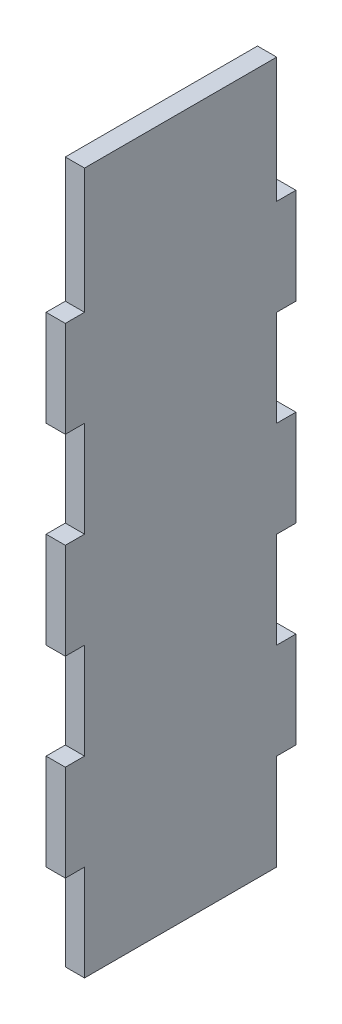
ISO-10303-21;
HEADER;
FILE_DESCRIPTION(('STEP AP214'),'2;1');
FILE_NAME('part.step','',(''),(''),'','','');
FILE_SCHEMA(('AUTOMOTIVE_DESIGN { 1 0 10303 214 1 1 1 1 }'));
ENDSEC;
DATA;
#1=APPLICATION_CONTEXT('core data for automotive mechanical design processes');
#2=APPLICATION_PROTOCOL_DEFINITION('international standard','automotive_design',2000,#1);
#3=PRODUCT_CONTEXT('',#1,'mechanical');
#4=PRODUCT('Part','Part','',(#3));
#5=PRODUCT_RELATED_PRODUCT_CATEGORY('part','',(#4));
#6=PRODUCT_DEFINITION_FORMATION('','',#4);
#7=PRODUCT_DEFINITION_CONTEXT('part definition',#1,'design');
#8=PRODUCT_DEFINITION('design','',#6,#7);
#9=PRODUCT_DEFINITION_SHAPE('','',#8);
#10=(LENGTH_UNIT() NAMED_UNIT(*) SI_UNIT(.MILLI.,.METRE.));
#11=(NAMED_UNIT(*) PLANE_ANGLE_UNIT() SI_UNIT($,.RADIAN.));
#12=(NAMED_UNIT(*) SI_UNIT($,.STERADIAN.) SOLID_ANGLE_UNIT());
#13=UNCERTAINTY_MEASURE_WITH_UNIT(LENGTH_MEASURE(1.E-05),#10,'distance_accuracy_value','');
#14=(GEOMETRIC_REPRESENTATION_CONTEXT(3) GLOBAL_UNCERTAINTY_ASSIGNED_CONTEXT((#13)) GLOBAL_UNIT_ASSIGNED_CONTEXT((#10,
#11,#12)) REPRESENTATION_CONTEXT('',''));
#15=CARTESIAN_POINT('',(0.,0.,0.));
#16=DIRECTION('',(0.,0.,1.));
#17=DIRECTION('',(1.,0.,0.));
#18=AXIS2_PLACEMENT_3D('',#15,#16,#17);
#19=CARTESIAN_POINT('',(0.,108.68170064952,20.));
#20=DIRECTION('',(0.,0.,1.));
#21=DIRECTION('',(-1.,0.,0.));
#22=AXIS2_PLACEMENT_3D('',#19,#20,#21);
#23=PLANE('',#22);
#24=DIRECTION('',(0.,-1.,0.));
#25=VECTOR('',#24,1.);
#26=CARTESIAN_POINT('',(-30.,-4.,20.));
#27=LINE('',#26,#25);
#28=CARTESIAN_POINT('',(-30.,26.,20.));
#29=VERTEX_POINT('',#28);
#30=CARTESIAN_POINT('',(-30.,16.,20.));
#31=VERTEX_POINT('',#30);
#32=EDGE_CURVE('E59',#29,#31,#27,.T.);
#33=ORIENTED_EDGE('',*,*,#32,.T.);
#34=DIRECTION('',(-1.,0.,0.));
#35=VECTOR('',#34,1.);
#36=CARTESIAN_POINT('',(-30.,16.,20.));
#37=LINE('',#36,#35);
#38=CARTESIAN_POINT('',(-28.,16.,20.));
#39=VERTEX_POINT('',#38);
#40=EDGE_CURVE('E244',#39,#31,#37,.T.);
#41=ORIENTED_EDGE('',*,*,#40,.F.);
#42=DIRECTION('',(0.,1.,0.));
#43=VECTOR('',#42,1.);
#44=CARTESIAN_POINT('',(-28.,-4.,20.));
#45=LINE('',#44,#43);
#46=CARTESIAN_POINT('',(-28.,26.,20.));
#47=VERTEX_POINT('',#46);
#48=EDGE_CURVE('E43',#39,#47,#45,.T.);
#49=ORIENTED_EDGE('',*,*,#48,.T.);
#50=DIRECTION('',(1.,0.,0.));
#51=VECTOR('',#50,1.);
#52=CARTESIAN_POINT('',(-28.,26.,20.));
#53=LINE('',#52,#51);
#54=EDGE_CURVE('E248',#29,#47,#53,.T.);
#55=ORIENTED_EDGE('',*,*,#54,.F.);
#56=EDGE_LOOP('',(#33,#41,#49,#55));
#57=FACE_BOUND('',#56,.T.);
#58=ADVANCED_FACE('F34',(#57),#23,.T.);
#59=CARTESIAN_POINT('',(-28.,-4.,20.));
#60=VERTEX_POINT('',#59);
#61=CARTESIAN_POINT('',(-28.,6.,20.));
#62=VERTEX_POINT('',#61);
#63=EDGE_CURVE('E11',#60,#62,#45,.T.);
#64=ORIENTED_EDGE('',*,*,#63,.T.);
#65=DIRECTION('',(1.,0.,0.));
#66=VECTOR('',#65,1.);
#67=CARTESIAN_POINT('',(-28.,6.,20.));
#68=LINE('',#67,#66);
#69=CARTESIAN_POINT('',(-30.,6.,20.));
#70=VERTEX_POINT('',#69);
#71=EDGE_CURVE('E51',#70,#62,#68,.T.);
#72=ORIENTED_EDGE('',*,*,#71,.F.);
#73=CARTESIAN_POINT('',(-30.,-4.,20.));
#74=VERTEX_POINT('',#73);
#75=EDGE_CURVE('E404',#70,#74,#27,.T.);
#76=ORIENTED_EDGE('',*,*,#75,.T.);
#77=DIRECTION('',(1.,0.,0.));
#78=VECTOR('',#77,1.);
#79=CARTESIAN_POINT('',(-30.,-4.,20.));
#80=LINE('',#79,#78);
#81=EDGE_CURVE('E398',#74,#60,#80,.T.);
#82=ORIENTED_EDGE('',*,*,#81,.T.);
#83=EDGE_LOOP('',(#64,#72,#76,#82));
#84=FACE_BOUND('',#83,.T.);
#85=ADVANCED_FACE('F467',(#84),#23,.T.);
#86=CARTESIAN_POINT('',(-30.,46.,20.));
#87=VERTEX_POINT('',#86);
#88=CARTESIAN_POINT('',(-30.,36.,20.));
#89=VERTEX_POINT('',#88);
#90=EDGE_CURVE('E403',#87,#89,#27,.T.);
#91=ORIENTED_EDGE('',*,*,#90,.T.);
#92=DIRECTION('',(-1.,0.,0.));
#93=VECTOR('',#92,1.);
#94=CARTESIAN_POINT('',(-30.,36.,20.));
#95=LINE('',#94,#93);
#96=CARTESIAN_POINT('',(-28.,36.,20.));
#97=VERTEX_POINT('',#96);
#98=EDGE_CURVE('E245',#97,#89,#95,.T.);
#99=ORIENTED_EDGE('',*,*,#98,.F.);
#100=CARTESIAN_POINT('',(-28.,46.,20.));
#101=VERTEX_POINT('',#100);
#102=EDGE_CURVE('E488',#97,#101,#45,.T.);
#103=ORIENTED_EDGE('',*,*,#102,.T.);
#104=DIRECTION('',(1.,0.,0.));
#105=VECTOR('',#104,1.);
#106=CARTESIAN_POINT('',(-28.,46.,20.));
#107=LINE('',#106,#105);
#108=EDGE_CURVE('E282',#87,#101,#107,.T.);
#109=ORIENTED_EDGE('',*,*,#108,.F.);
#110=EDGE_LOOP('',(#91,#99,#103,#109));
#111=FACE_BOUND('',#110,.T.);
#112=ADVANCED_FACE('F36',(#111),#23,.T.);
#113=DIRECTION('',(-1.,0.,0.));
#114=VECTOR('',#113,1.);
#115=CARTESIAN_POINT('',(-30.,56.,20.));
#116=LINE('',#115,#114);
#117=CARTESIAN_POINT('',(-28.,56.,20.));
#118=VERTEX_POINT('',#117);
#119=CARTESIAN_POINT('',(-30.,56.,20.));
#120=VERTEX_POINT('',#119);
#121=EDGE_CURVE('E277',#118,#120,#116,.T.);
#122=ORIENTED_EDGE('',*,*,#121,.F.);
#123=CARTESIAN_POINT('',(-28.,69.,20.));
#124=VERTEX_POINT('',#123);
#125=EDGE_CURVE('E45',#118,#124,#45,.T.);
#126=ORIENTED_EDGE('',*,*,#125,.T.);
#127=DIRECTION('',(-1.,0.,0.));
#128=VECTOR('',#127,1.);
#129=CARTESIAN_POINT('',(-30.,69.,20.));
#130=LINE('',#129,#128);
#131=CARTESIAN_POINT('',(-30.,69.,20.));
#132=VERTEX_POINT('',#131);
#133=EDGE_CURVE('E381',#124,#132,#130,.T.);
#134=ORIENTED_EDGE('',*,*,#133,.T.);
#135=EDGE_CURVE('E401',#132,#120,#27,.T.);
#136=ORIENTED_EDGE('',*,*,#135,.T.);
#137=EDGE_LOOP('',(#122,#126,#134,#136));
#138=FACE_BOUND('',#137,.T.);
#139=ADVANCED_FACE('F471',(#138),#23,.T.);
#140=CARTESIAN_POINT('',(0.,0.,0.));
#141=DIRECTION('',(0.,0.,-1.));
#142=DIRECTION('',(-1.,0.,0.));
#143=AXIS2_PLACEMENT_3D('',#140,#141,#142);
#144=PLANE('',#143);
#145=DIRECTION('',(0.,-1.,0.));
#146=VECTOR('',#145,1.);
#147=CARTESIAN_POINT('',(-30.,-4.,0.));
#148=LINE('',#147,#146);
#149=CARTESIAN_POINT('',(-30.,46.,0.));
#150=VERTEX_POINT('',#149);
#151=CARTESIAN_POINT('',(-30.,36.,0.));
#152=VERTEX_POINT('',#151);
#153=EDGE_CURVE('E395',#150,#152,#148,.T.);
#154=ORIENTED_EDGE('',*,*,#153,.F.);
#155=DIRECTION('',(-1.,0.,0.));
#156=VECTOR('',#155,1.);
#157=CARTESIAN_POINT('',(-28.,46.,0.));
#158=LINE('',#157,#156);
#159=CARTESIAN_POINT('',(-28.,46.,0.));
#160=VERTEX_POINT('',#159);
#161=EDGE_CURVE('E304',#160,#150,#158,.T.);
#162=ORIENTED_EDGE('',*,*,#161,.F.);
#163=DIRECTION('',(0.,1.,0.));
#164=VECTOR('',#163,1.);
#165=CARTESIAN_POINT('',(-28.,-4.,0.));
#166=LINE('',#165,#164);
#167=CARTESIAN_POINT('',(-28.,36.,0.));
#168=VERTEX_POINT('',#167);
#169=EDGE_CURVE('E444',#168,#160,#166,.T.);
#170=ORIENTED_EDGE('',*,*,#169,.F.);
#171=DIRECTION('',(1.,0.,0.));
#172=VECTOR('',#171,1.);
#173=CARTESIAN_POINT('',(-28.,36.,0.));
#174=LINE('',#173,#172);
#175=EDGE_CURVE('E332',#152,#168,#174,.T.);
#176=ORIENTED_EDGE('',*,*,#175,.F.);
#177=EDGE_LOOP('',(#154,#162,#170,#176));
#178=FACE_BOUND('',#177,.T.);
#179=ADVANCED_FACE('F442',(#178),#144,.T.);
#180=CARTESIAN_POINT('',(-28.,56.,0.));
#181=VERTEX_POINT('',#180);
#182=CARTESIAN_POINT('',(-28.,69.,0.));
#183=VERTEX_POINT('',#182);
#184=EDGE_CURVE('E387',#181,#183,#166,.T.);
#185=ORIENTED_EDGE('',*,*,#184,.F.);
#186=DIRECTION('',(1.,0.,0.));
#187=VECTOR('',#186,1.);
#188=CARTESIAN_POINT('',(-28.,56.,0.));
#189=LINE('',#188,#187);
#190=CARTESIAN_POINT('',(-30.,56.,0.));
#191=VERTEX_POINT('',#190);
#192=EDGE_CURVE('E309',#191,#181,#189,.T.);
#193=ORIENTED_EDGE('',*,*,#192,.F.);
#194=CARTESIAN_POINT('',(-30.,69.,0.));
#195=VERTEX_POINT('',#194);
#196=EDGE_CURVE('E393',#195,#191,#148,.T.);
#197=ORIENTED_EDGE('',*,*,#196,.F.);
#198=DIRECTION('',(-1.,0.,0.));
#199=VECTOR('',#198,1.);
#200=CARTESIAN_POINT('',(-30.,69.,0.));
#201=LINE('',#200,#199);
#202=EDGE_CURVE('E378',#183,#195,#201,.T.);
#203=ORIENTED_EDGE('',*,*,#202,.F.);
#204=EDGE_LOOP('',(#185,#193,#197,#203));
#205=FACE_BOUND('',#204,.T.);
#206=ADVANCED_FACE('F420',(#205),#144,.T.);
#207=CARTESIAN_POINT('',(-30.,26.,0.));
#208=VERTEX_POINT('',#207);
#209=CARTESIAN_POINT('',(-30.,16.,0.));
#210=VERTEX_POINT('',#209);
#211=EDGE_CURVE('E425',#208,#210,#148,.T.);
#212=ORIENTED_EDGE('',*,*,#211,.F.);
#213=DIRECTION('',(-1.,0.,0.));
#214=VECTOR('',#213,1.);
#215=CARTESIAN_POINT('',(-28.,26.,0.));
#216=LINE('',#215,#214);
#217=CARTESIAN_POINT('',(-28.,26.,0.));
#218=VERTEX_POINT('',#217);
#219=EDGE_CURVE('E327',#218,#208,#216,.T.);
#220=ORIENTED_EDGE('',*,*,#219,.F.);
#221=CARTESIAN_POINT('',(-28.,16.,0.));
#222=VERTEX_POINT('',#221);
#223=EDGE_CURVE('E386',#222,#218,#166,.T.);
#224=ORIENTED_EDGE('',*,*,#223,.F.);
#225=DIRECTION('',(1.,0.,0.));
#226=VECTOR('',#225,1.);
#227=CARTESIAN_POINT('',(-28.,16.,0.));
#228=LINE('',#227,#226);
#229=EDGE_CURVE('E356',#210,#222,#228,.T.);
#230=ORIENTED_EDGE('',*,*,#229,.F.);
#231=EDGE_LOOP('',(#212,#220,#224,#230));
#232=FACE_BOUND('',#231,.T.);
#233=ADVANCED_FACE('F623',(#232),#144,.T.);
#234=CARTESIAN_POINT('',(-30.,-4.,93.0273921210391));
#235=DIRECTION('',(1.,0.,0.));
#236=DIRECTION('',(0.,0.,-1.));
#237=AXIS2_PLACEMENT_3D('',#234,#235,#236);
#238=PLANE('',#237);
#239=ORIENTED_EDGE('',*,*,#135,.F.);
#240=DIRECTION('',(0.,0.,-1.));
#241=VECTOR('',#240,1.);
#242=CARTESIAN_POINT('',(-30.,69.,93.0273921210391));
#243=LINE('',#242,#241);
#244=EDGE_CURVE('E38',#132,#195,#243,.T.);
#245=ORIENTED_EDGE('',*,*,#244,.T.);
#246=ORIENTED_EDGE('',*,*,#196,.T.);
#247=DIRECTION('',(0.,0.,1.));
#248=VECTOR('',#247,1.);
#249=CARTESIAN_POINT('',(-30.,56.,-2.));
#250=LINE('',#249,#248);
#251=CARTESIAN_POINT('',(-30.,56.,-2.));
#252=VERTEX_POINT('',#251);
#253=EDGE_CURVE('E320',#252,#191,#250,.T.);
#254=ORIENTED_EDGE('',*,*,#253,.F.);
#255=DIRECTION('',(0.,1.,0.));
#256=VECTOR('',#255,1.);
#257=CARTESIAN_POINT('',(-30.,46.,-2.));
#258=LINE('',#257,#256);
#259=CARTESIAN_POINT('',(-30.,46.,-2.));
#260=VERTEX_POINT('',#259);
#261=EDGE_CURVE('E311',#260,#252,#258,.T.);
#262=ORIENTED_EDGE('',*,*,#261,.F.);
#263=DIRECTION('',(0.,0.,1.));
#264=VECTOR('',#263,1.);
#265=CARTESIAN_POINT('',(-30.,46.,-2.));
#266=LINE('',#265,#264);
#267=EDGE_CURVE('E322',#260,#150,#266,.T.);
#268=ORIENTED_EDGE('',*,*,#267,.T.);
#269=ORIENTED_EDGE('',*,*,#153,.T.);
#270=DIRECTION('',(0.,0.,1.));
#271=VECTOR('',#270,1.);
#272=CARTESIAN_POINT('',(-30.,36.,-2.));
#273=LINE('',#272,#271);
#274=CARTESIAN_POINT('',(-30.,36.,-2.));
#275=VERTEX_POINT('',#274);
#276=EDGE_CURVE('E343',#275,#152,#273,.T.);
#277=ORIENTED_EDGE('',*,*,#276,.F.);
#278=DIRECTION('',(0.,1.,0.));
#279=VECTOR('',#278,1.);
#280=CARTESIAN_POINT('',(-30.,26.,-2.));
#281=LINE('',#280,#279);
#282=CARTESIAN_POINT('',(-30.,26.,-2.));
#283=VERTEX_POINT('',#282);
#284=EDGE_CURVE('E334',#283,#275,#281,.T.);
#285=ORIENTED_EDGE('',*,*,#284,.F.);
#286=DIRECTION('',(0.,0.,1.));
#287=VECTOR('',#286,1.);
#288=CARTESIAN_POINT('',(-30.,26.,-2.));
#289=LINE('',#288,#287);
#290=EDGE_CURVE('E346',#283,#208,#289,.T.);
#291=ORIENTED_EDGE('',*,*,#290,.T.);
#292=ORIENTED_EDGE('',*,*,#211,.T.);
#293=DIRECTION('',(0.,0.,1.));
#294=VECTOR('',#293,1.);
#295=CARTESIAN_POINT('',(-30.,16.,-2.));
#296=LINE('',#295,#294);
#297=CARTESIAN_POINT('',(-30.,16.,-2.));
#298=VERTEX_POINT('',#297);
#299=EDGE_CURVE('E369',#298,#210,#296,.T.);
#300=ORIENTED_EDGE('',*,*,#299,.F.);
#301=DIRECTION('',(0.,1.,0.));
#302=VECTOR('',#301,1.);
#303=CARTESIAN_POINT('',(-30.,6.,-2.));
#304=LINE('',#303,#302);
#305=CARTESIAN_POINT('',(-30.,6.,-2.));
#306=VERTEX_POINT('',#305);
#307=EDGE_CURVE('E358',#306,#298,#304,.T.);
#308=ORIENTED_EDGE('',*,*,#307,.F.);
#309=DIRECTION('',(0.,0.,1.));
#310=VECTOR('',#309,1.);
#311=CARTESIAN_POINT('',(-30.,6.,-2.));
#312=LINE('',#311,#310);
#313=CARTESIAN_POINT('',(-30.,6.,0.));
#314=VERTEX_POINT('',#313);
#315=EDGE_CURVE('E372',#306,#314,#312,.T.);
#316=ORIENTED_EDGE('',*,*,#315,.T.);
#317=CARTESIAN_POINT('',(-30.,-4.,0.));
#318=VERTEX_POINT('',#317);
#319=EDGE_CURVE('E396',#314,#318,#148,.T.);
#320=ORIENTED_EDGE('',*,*,#319,.T.);
#321=DIRECTION('',(0.,0.,-1.));
#322=VECTOR('',#321,1.);
#323=CARTESIAN_POINT('',(-30.,-4.,93.0273921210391));
#324=LINE('',#323,#322);
#325=EDGE_CURVE('E392',#74,#318,#324,.T.);
#326=ORIENTED_EDGE('',*,*,#325,.F.);
#327=ORIENTED_EDGE('',*,*,#75,.F.);
#328=DIRECTION('',(0.,0.,-1.));
#329=VECTOR('',#328,1.);
#330=CARTESIAN_POINT('',(-30.,6.,22.));
#331=LINE('',#330,#329);
#332=CARTESIAN_POINT('',(-30.,6.,22.));
#333=VERTEX_POINT('',#332);
#334=EDGE_CURVE('E229',#333,#70,#331,.T.);
#335=ORIENTED_EDGE('',*,*,#334,.F.);
#336=DIRECTION('',(0.,-1.,0.));
#337=VECTOR('',#336,1.);
#338=CARTESIAN_POINT('',(-30.,6.,22.));
#339=LINE('',#338,#337);
#340=CARTESIAN_POINT('',(-30.,16.,22.));
#341=VERTEX_POINT('',#340);
#342=EDGE_CURVE('E221',#341,#333,#339,.T.);
#343=ORIENTED_EDGE('',*,*,#342,.F.);
#344=DIRECTION('',(0.,0.,-1.));
#345=VECTOR('',#344,1.);
#346=CARTESIAN_POINT('',(-30.,16.,22.));
#347=LINE('',#346,#345);
#348=EDGE_CURVE('E226',#341,#31,#347,.T.);
#349=ORIENTED_EDGE('',*,*,#348,.T.);
#350=ORIENTED_EDGE('',*,*,#32,.F.);
#351=DIRECTION('',(0.,0.,-1.));
#352=VECTOR('',#351,1.);
#353=CARTESIAN_POINT('',(-30.,26.,22.));
#354=LINE('',#353,#352);
#355=CARTESIAN_POINT('',(-30.,26.,22.));
#356=VERTEX_POINT('',#355);
#357=EDGE_CURVE('E271',#356,#29,#354,.T.);
#358=ORIENTED_EDGE('',*,*,#357,.F.);
#359=DIRECTION('',(0.,-1.,0.));
#360=VECTOR('',#359,1.);
#361=CARTESIAN_POINT('',(-30.,26.,22.));
#362=LINE('',#361,#360);
#363=CARTESIAN_POINT('',(-30.,36.,22.));
#364=VERTEX_POINT('',#363);
#365=EDGE_CURVE('E257',#364,#356,#362,.T.);
#366=ORIENTED_EDGE('',*,*,#365,.F.);
#367=DIRECTION('',(0.,0.,-1.));
#368=VECTOR('',#367,1.);
#369=CARTESIAN_POINT('',(-30.,36.,22.));
#370=LINE('',#369,#368);
#371=EDGE_CURVE('E274',#364,#89,#370,.T.);
#372=ORIENTED_EDGE('',*,*,#371,.T.);
#373=ORIENTED_EDGE('',*,*,#90,.F.);
#374=DIRECTION('',(0.,0.,-1.));
#375=VECTOR('',#374,1.);
#376=CARTESIAN_POINT('',(-30.,46.,22.));
#377=LINE('',#376,#375);
#378=CARTESIAN_POINT('',(-30.,46.,22.));
#379=VERTEX_POINT('',#378);
#380=EDGE_CURVE('E298',#379,#87,#377,.T.);
#381=ORIENTED_EDGE('',*,*,#380,.F.);
#382=DIRECTION('',(0.,-1.,0.));
#383=VECTOR('',#382,1.);
#384=CARTESIAN_POINT('',(-30.,46.,22.));
#385=LINE('',#384,#383);
#386=CARTESIAN_POINT('',(-30.,56.,22.));
#387=VERTEX_POINT('',#386);
#388=EDGE_CURVE('E281',#387,#379,#385,.T.);
#389=ORIENTED_EDGE('',*,*,#388,.F.);
#390=DIRECTION('',(0.,0.,-1.));
#391=VECTOR('',#390,1.);
#392=CARTESIAN_POINT('',(-30.,56.,22.));
#393=LINE('',#392,#391);
#394=EDGE_CURVE('E301',#387,#120,#393,.T.);
#395=ORIENTED_EDGE('',*,*,#394,.T.);
#396=EDGE_LOOP('',(#239,#245,#246,#254,#262,#268,#269,#277,#285,#291,#292,#300,#308,#316,#320,
#326,#327,#335,#343,#349,#350,#358,#366,#372,#373,#381,#389,#395));
#397=FACE_BOUND('',#396,.T.);
#398=ADVANCED_FACE('F224',(#397),#238,.F.);
#399=CARTESIAN_POINT('',(-30.,-4.,93.0273921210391));
#400=DIRECTION('',(0.,1.,0.));
#401=DIRECTION('',(0.,0.,1.));
#402=AXIS2_PLACEMENT_3D('',#399,#400,#401);
#403=PLANE('',#402);
#404=ORIENTED_EDGE('',*,*,#81,.F.);
#405=ORIENTED_EDGE('',*,*,#325,.T.);
#406=DIRECTION('',(1.,0.,0.));
#407=VECTOR('',#406,1.);
#408=CARTESIAN_POINT('',(-30.,-4.,0.));
#409=LINE('',#408,#407);
#410=CARTESIAN_POINT('',(-28.,-4.,0.));
#411=VERTEX_POINT('',#410);
#412=EDGE_CURVE('E388',#318,#411,#409,.T.);
#413=ORIENTED_EDGE('',*,*,#412,.T.);
#414=DIRECTION('',(0.,0.,-1.));
#415=VECTOR('',#414,1.);
#416=CARTESIAN_POINT('',(-28.,-4.,93.0273921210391));
#417=LINE('',#416,#415);
#418=EDGE_CURVE('E391',#60,#411,#417,.T.);
#419=ORIENTED_EDGE('',*,*,#418,.F.);
#420=EDGE_LOOP('',(#404,#405,#413,#419));
#421=FACE_BOUND('',#420,.T.);
#422=ADVANCED_FACE('F605',(#421),#403,.F.);
#423=CARTESIAN_POINT('',(-28.,-4.,93.0273921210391));
#424=DIRECTION('',(-1.,0.,0.));
#425=DIRECTION('',(0.,0.,1.));
#426=AXIS2_PLACEMENT_3D('',#423,#424,#425);
#427=PLANE('',#426);
#428=ORIENTED_EDGE('',*,*,#63,.F.);
#429=ORIENTED_EDGE('',*,*,#418,.T.);
#430=CARTESIAN_POINT('',(-28.,6.,0.));
#431=VERTEX_POINT('',#430);
#432=EDGE_CURVE('E383',#411,#431,#166,.T.);
#433=ORIENTED_EDGE('',*,*,#432,.T.);
#434=DIRECTION('',(0.,0.,1.));
#435=VECTOR('',#434,1.);
#436=CARTESIAN_POINT('',(-28.,6.,-2.));
#437=LINE('',#436,#435);
#438=CARTESIAN_POINT('',(-28.,6.,-2.));
#439=VERTEX_POINT('',#438);
#440=EDGE_CURVE('E375',#439,#431,#437,.T.);
#441=ORIENTED_EDGE('',*,*,#440,.F.);
#442=DIRECTION('',(0.,-1.,0.));
#443=VECTOR('',#442,1.);
#444=CARTESIAN_POINT('',(-28.,6.,-2.));
#445=LINE('',#444,#443);
#446=CARTESIAN_POINT('',(-28.,16.,-2.));
#447=VERTEX_POINT('',#446);
#448=EDGE_CURVE('E352',#447,#439,#445,.T.);
#449=ORIENTED_EDGE('',*,*,#448,.F.);
#450=DIRECTION('',(0.,0.,1.));
#451=VECTOR('',#450,1.);
#452=CARTESIAN_POINT('',(-28.,16.,-2.));
#453=LINE('',#452,#451);
#454=EDGE_CURVE('E362',#447,#222,#453,.T.);
#455=ORIENTED_EDGE('',*,*,#454,.T.);
#456=ORIENTED_EDGE('',*,*,#223,.T.);
#457=DIRECTION('',(0.,0.,1.));
#458=VECTOR('',#457,1.);
#459=CARTESIAN_POINT('',(-28.,26.,-2.));
#460=LINE('',#459,#458);
#461=CARTESIAN_POINT('',(-28.,26.,-2.));
#462=VERTEX_POINT('',#461);
#463=EDGE_CURVE('E349',#462,#218,#460,.T.);
#464=ORIENTED_EDGE('',*,*,#463,.F.);
#465=DIRECTION('',(0.,-1.,0.));
#466=VECTOR('',#465,1.);
#467=CARTESIAN_POINT('',(-28.,26.,-2.));
#468=LINE('',#467,#466);
#469=CARTESIAN_POINT('',(-28.,36.,-2.));
#470=VERTEX_POINT('',#469);
#471=EDGE_CURVE('E328',#470,#462,#468,.T.);
#472=ORIENTED_EDGE('',*,*,#471,.F.);
#473=DIRECTION('',(0.,0.,1.));
#474=VECTOR('',#473,1.);
#475=CARTESIAN_POINT('',(-28.,36.,-2.));
#476=LINE('',#475,#474);
#477=EDGE_CURVE('E338',#470,#168,#476,.T.);
#478=ORIENTED_EDGE('',*,*,#477,.T.);
#479=ORIENTED_EDGE('',*,*,#169,.T.);
#480=DIRECTION('',(0.,0.,1.));
#481=VECTOR('',#480,1.);
#482=CARTESIAN_POINT('',(-28.,46.,-2.));
#483=LINE('',#482,#481);
#484=CARTESIAN_POINT('',(-28.,46.,-2.));
#485=VERTEX_POINT('',#484);
#486=EDGE_CURVE('E325',#485,#160,#483,.T.);
#487=ORIENTED_EDGE('',*,*,#486,.F.);
#488=DIRECTION('',(0.,-1.,0.));
#489=VECTOR('',#488,1.);
#490=CARTESIAN_POINT('',(-28.,46.,-2.));
#491=LINE('',#490,#489);
#492=CARTESIAN_POINT('',(-28.,56.,-2.));
#493=VERTEX_POINT('',#492);
#494=EDGE_CURVE('E305',#493,#485,#491,.T.);
#495=ORIENTED_EDGE('',*,*,#494,.F.);
#496=DIRECTION('',(0.,0.,1.));
#497=VECTOR('',#496,1.);
#498=CARTESIAN_POINT('',(-28.,56.,-2.));
#499=LINE('',#498,#497);
#500=EDGE_CURVE('E315',#493,#181,#499,.T.);
#501=ORIENTED_EDGE('',*,*,#500,.T.);
#502=ORIENTED_EDGE('',*,*,#184,.T.);
#503=DIRECTION('',(0.,0.,-1.));
#504=VECTOR('',#503,1.);
#505=CARTESIAN_POINT('',(-28.,69.,93.0273921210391));
#506=LINE('',#505,#504);
#507=EDGE_CURVE('E382',#124,#183,#506,.T.);
#508=ORIENTED_EDGE('',*,*,#507,.F.);
#509=ORIENTED_EDGE('',*,*,#125,.F.);
#510=DIRECTION('',(0.,0.,-1.));
#511=VECTOR('',#510,1.);
#512=CARTESIAN_POINT('',(-28.,56.,22.));
#513=LINE('',#512,#511);
#514=CARTESIAN_POINT('',(-28.,56.,22.));
#515=VERTEX_POINT('',#514);
#516=EDGE_CURVE('E288',#515,#118,#513,.T.);
#517=ORIENTED_EDGE('',*,*,#516,.F.);
#518=DIRECTION('',(0.,1.,0.));
#519=VECTOR('',#518,1.);
#520=CARTESIAN_POINT('',(-28.,56.,22.));
#521=LINE('',#520,#519);
#522=CARTESIAN_POINT('',(-28.,46.,22.));
#523=VERTEX_POINT('',#522);
#524=EDGE_CURVE('E286',#523,#515,#521,.T.);
#525=ORIENTED_EDGE('',*,*,#524,.F.);
#526=DIRECTION('',(0.,0.,-1.));
#527=VECTOR('',#526,1.);
#528=CARTESIAN_POINT('',(-28.,46.,22.));
#529=LINE('',#528,#527);
#530=EDGE_CURVE('E295',#523,#101,#529,.T.);
#531=ORIENTED_EDGE('',*,*,#530,.T.);
#532=ORIENTED_EDGE('',*,*,#102,.F.);
#533=DIRECTION('',(0.,0.,-1.));
#534=VECTOR('',#533,1.);
#535=CARTESIAN_POINT('',(-28.,36.,22.));
#536=LINE('',#535,#534);
#537=CARTESIAN_POINT('',(-28.,36.,22.));
#538=VERTEX_POINT('',#537);
#539=EDGE_CURVE('E262',#538,#97,#536,.T.);
#540=ORIENTED_EDGE('',*,*,#539,.F.);
#541=DIRECTION('',(0.,1.,0.));
#542=VECTOR('',#541,1.);
#543=CARTESIAN_POINT('',(-28.,36.,22.));
#544=LINE('',#543,#542);
#545=CARTESIAN_POINT('',(-28.,26.,22.));
#546=VERTEX_POINT('',#545);
#547=EDGE_CURVE('E261',#546,#538,#544,.T.);
#548=ORIENTED_EDGE('',*,*,#547,.F.);
#549=DIRECTION('',(0.,0.,-1.));
#550=VECTOR('',#549,1.);
#551=CARTESIAN_POINT('',(-28.,26.,22.));
#552=LINE('',#551,#550);
#553=EDGE_CURVE('E268',#546,#47,#552,.T.);
#554=ORIENTED_EDGE('',*,*,#553,.T.);
#555=ORIENTED_EDGE('',*,*,#48,.F.);
#556=DIRECTION('',(0.,0.,-1.));
#557=VECTOR('',#556,1.);
#558=CARTESIAN_POINT('',(-28.,16.,22.));
#559=LINE('',#558,#557);
#560=CARTESIAN_POINT('',(-28.,16.,22.));
#561=VERTEX_POINT('',#560);
#562=EDGE_CURVE('E596',#561,#39,#559,.T.);
#563=ORIENTED_EDGE('',*,*,#562,.F.);
#564=DIRECTION('',(0.,1.,0.));
#565=VECTOR('',#564,1.);
#566=CARTESIAN_POINT('',(-28.,16.,22.));
#567=LINE('',#566,#565);
#568=CARTESIAN_POINT('',(-28.,6.,22.));
#569=VERTEX_POINT('',#568);
#570=EDGE_CURVE('E238',#569,#561,#567,.T.);
#571=ORIENTED_EDGE('',*,*,#570,.F.);
#572=DIRECTION('',(0.,0.,-1.));
#573=VECTOR('',#572,1.);
#574=CARTESIAN_POINT('',(-28.,6.,22.));
#575=LINE('',#574,#573);
#576=EDGE_CURVE('E250',#569,#62,#575,.T.);
#577=ORIENTED_EDGE('',*,*,#576,.T.);
#578=EDGE_LOOP('',(#428,#429,#433,#441,#449,#455,#456,#464,#472,#478,#479,#487,#495,#501,#502,
#508,#509,#517,#525,#531,#532,#540,#548,#554,#555,#563,#571,#577));
#579=FACE_BOUND('',#578,.T.);
#580=ADVANCED_FACE('F447',(#579),#427,.F.);
#581=CARTESIAN_POINT('',(-30.,69.,93.0273921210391));
#582=DIRECTION('',(0.,-1.,0.));
#583=DIRECTION('',(0.,0.,-1.));
#584=AXIS2_PLACEMENT_3D('',#581,#582,#583);
#585=PLANE('',#584);
#586=ORIENTED_EDGE('',*,*,#133,.F.);
#587=ORIENTED_EDGE('',*,*,#507,.T.);
#588=ORIENTED_EDGE('',*,*,#202,.T.);
#589=ORIENTED_EDGE('',*,*,#244,.F.);
#590=EDGE_LOOP('',(#586,#587,#588,#589));
#591=FACE_BOUND('',#590,.T.);
#592=ADVANCED_FACE('F414',(#591),#585,.F.);
#593=DIRECTION('',(-1.,0.,0.));
#594=VECTOR('',#593,1.);
#595=CARTESIAN_POINT('',(-28.,6.,0.));
#596=LINE('',#595,#594);
#597=EDGE_CURVE('E351',#431,#314,#596,.T.);
#598=ORIENTED_EDGE('',*,*,#597,.F.);
#599=ORIENTED_EDGE('',*,*,#432,.F.);
#600=ORIENTED_EDGE('',*,*,#412,.F.);
#601=ORIENTED_EDGE('',*,*,#319,.F.);
#602=EDGE_LOOP('',(#598,#599,#600,#601));
#603=FACE_BOUND('',#602,.T.);
#604=ADVANCED_FACE('F642',(#603),#144,.T.);
#605=CARTESIAN_POINT('',(-28.,6.,-2.));
#606=DIRECTION('',(0.,1.,0.));
#607=DIRECTION('',(0.,0.,1.));
#608=AXIS2_PLACEMENT_3D('',#605,#606,#607);
#609=PLANE('',#608);
#610=ORIENTED_EDGE('',*,*,#597,.T.);
#611=ORIENTED_EDGE('',*,*,#315,.F.);
#612=DIRECTION('',(-1.,0.,0.));
#613=VECTOR('',#612,1.);
#614=CARTESIAN_POINT('',(-28.,6.,-2.));
#615=LINE('',#614,#613);
#616=EDGE_CURVE('E355',#439,#306,#615,.T.);
#617=ORIENTED_EDGE('',*,*,#616,.F.);
#618=ORIENTED_EDGE('',*,*,#440,.T.);
#619=EDGE_LOOP('',(#610,#611,#617,#618));
#620=FACE_BOUND('',#619,.T.);
#621=ADVANCED_FACE('F612',(#620),#609,.F.);
#622=CARTESIAN_POINT('',(-28.,16.,-2.));
#623=DIRECTION('',(0.,-1.,0.));
#624=DIRECTION('',(0.,0.,-1.));
#625=AXIS2_PLACEMENT_3D('',#622,#623,#624);
#626=PLANE('',#625);
#627=ORIENTED_EDGE('',*,*,#229,.T.);
#628=ORIENTED_EDGE('',*,*,#454,.F.);
#629=DIRECTION('',(1.,0.,0.));
#630=VECTOR('',#629,1.);
#631=CARTESIAN_POINT('',(-28.,16.,-2.));
#632=LINE('',#631,#630);
#633=EDGE_CURVE('E360',#298,#447,#632,.T.);
#634=ORIENTED_EDGE('',*,*,#633,.F.);
#635=ORIENTED_EDGE('',*,*,#299,.T.);
#636=EDGE_LOOP('',(#627,#628,#634,#635));
#637=FACE_BOUND('',#636,.T.);
#638=ADVANCED_FACE('F621',(#637),#626,.F.);
#639=CARTESIAN_POINT('',(0.,0.,-2.));
#640=DIRECTION('',(0.,0.,1.));
#641=DIRECTION('',(1.,0.,0.));
#642=AXIS2_PLACEMENT_3D('',#639,#640,#641);
#643=PLANE('',#642);
#644=ORIENTED_EDGE('',*,*,#448,.T.);
#645=ORIENTED_EDGE('',*,*,#616,.T.);
#646=ORIENTED_EDGE('',*,*,#307,.T.);
#647=ORIENTED_EDGE('',*,*,#633,.T.);
#648=EDGE_LOOP('',(#644,#645,#646,#647));
#649=FACE_BOUND('',#648,.T.);
#650=ADVANCED_FACE('F616',(#649),#643,.F.);
#651=CARTESIAN_POINT('',(-28.,26.,-2.));
#652=DIRECTION('',(0.,1.,0.));
#653=DIRECTION('',(0.,0.,1.));
#654=AXIS2_PLACEMENT_3D('',#651,#652,#653);
#655=PLANE('',#654);
#656=ORIENTED_EDGE('',*,*,#219,.T.);
#657=ORIENTED_EDGE('',*,*,#290,.F.);
#658=DIRECTION('',(-1.,0.,0.));
#659=VECTOR('',#658,1.);
#660=CARTESIAN_POINT('',(-28.,26.,-2.));
#661=LINE('',#660,#659);
#662=EDGE_CURVE('E331',#462,#283,#661,.T.);
#663=ORIENTED_EDGE('',*,*,#662,.F.);
#664=ORIENTED_EDGE('',*,*,#463,.T.);
#665=EDGE_LOOP('',(#656,#657,#663,#664));
#666=FACE_BOUND('',#665,.T.);
#667=ADVANCED_FACE('F627',(#666),#655,.F.);
#668=CARTESIAN_POINT('',(-28.,36.,-2.));
#669=DIRECTION('',(0.,-1.,0.));
#670=DIRECTION('',(0.,0.,-1.));
#671=AXIS2_PLACEMENT_3D('',#668,#669,#670);
#672=PLANE('',#671);
#673=ORIENTED_EDGE('',*,*,#175,.T.);
#674=ORIENTED_EDGE('',*,*,#477,.F.);
#675=DIRECTION('',(1.,0.,0.));
#676=VECTOR('',#675,1.);
#677=CARTESIAN_POINT('',(-28.,36.,-2.));
#678=LINE('',#677,#676);
#679=EDGE_CURVE('E336',#275,#470,#678,.T.);
#680=ORIENTED_EDGE('',*,*,#679,.F.);
#681=ORIENTED_EDGE('',*,*,#276,.T.);
#682=EDGE_LOOP('',(#673,#674,#680,#681));
#683=FACE_BOUND('',#682,.T.);
#684=ADVANCED_FACE('F439',(#683),#672,.F.);
#685=CARTESIAN_POINT('',(0.,20.,-2.));
#686=DIRECTION('',(0.,0.,1.));
#687=DIRECTION('',(1.,0.,0.));
#688=AXIS2_PLACEMENT_3D('',#685,#686,#687);
#689=PLANE('',#688);
#690=ORIENTED_EDGE('',*,*,#471,.T.);
#691=ORIENTED_EDGE('',*,*,#662,.T.);
#692=ORIENTED_EDGE('',*,*,#284,.T.);
#693=ORIENTED_EDGE('',*,*,#679,.T.);
#694=EDGE_LOOP('',(#690,#691,#692,#693));
#695=FACE_BOUND('',#694,.T.);
#696=ADVANCED_FACE('F457',(#695),#689,.F.);
#697=CARTESIAN_POINT('',(-28.,46.,-2.));
#698=DIRECTION('',(0.,1.,0.));
#699=DIRECTION('',(0.,0.,1.));
#700=AXIS2_PLACEMENT_3D('',#697,#698,#699);
#701=PLANE('',#700);
#702=ORIENTED_EDGE('',*,*,#161,.T.);
#703=ORIENTED_EDGE('',*,*,#267,.F.);
#704=DIRECTION('',(-1.,0.,0.));
#705=VECTOR('',#704,1.);
#706=CARTESIAN_POINT('',(-28.,46.,-2.));
#707=LINE('',#706,#705);
#708=EDGE_CURVE('E308',#485,#260,#707,.T.);
#709=ORIENTED_EDGE('',*,*,#708,.F.);
#710=ORIENTED_EDGE('',*,*,#486,.T.);
#711=EDGE_LOOP('',(#702,#703,#709,#710));
#712=FACE_BOUND('',#711,.T.);
#713=ADVANCED_FACE('F455',(#712),#701,.F.);
#714=CARTESIAN_POINT('',(-28.,56.,-2.));
#715=DIRECTION('',(0.,-1.,0.));
#716=DIRECTION('',(0.,0.,-1.));
#717=AXIS2_PLACEMENT_3D('',#714,#715,#716);
#718=PLANE('',#717);
#719=ORIENTED_EDGE('',*,*,#192,.T.);
#720=ORIENTED_EDGE('',*,*,#500,.F.);
#721=DIRECTION('',(1.,0.,0.));
#722=VECTOR('',#721,1.);
#723=CARTESIAN_POINT('',(-28.,56.,-2.));
#724=LINE('',#723,#722);
#725=EDGE_CURVE('E313',#252,#493,#724,.T.);
#726=ORIENTED_EDGE('',*,*,#725,.F.);
#727=ORIENTED_EDGE('',*,*,#253,.T.);
#728=EDGE_LOOP('',(#719,#720,#726,#727));
#729=FACE_BOUND('',#728,.T.);
#730=ADVANCED_FACE('F451',(#729),#718,.F.);
#731=CARTESIAN_POINT('',(0.,40.,-2.));
#732=DIRECTION('',(0.,0.,1.));
#733=DIRECTION('',(1.,0.,0.));
#734=AXIS2_PLACEMENT_3D('',#731,#732,#733);
#735=PLANE('',#734);
#736=ORIENTED_EDGE('',*,*,#494,.T.);
#737=ORIENTED_EDGE('',*,*,#708,.T.);
#738=ORIENTED_EDGE('',*,*,#261,.T.);
#739=ORIENTED_EDGE('',*,*,#725,.T.);
#740=EDGE_LOOP('',(#736,#737,#738,#739));
#741=FACE_BOUND('',#740,.T.);
#742=ADVANCED_FACE('F453',(#741),#735,.F.);
#743=CARTESIAN_POINT('',(-30.,56.,22.));
#744=DIRECTION('',(0.,-1.,0.));
#745=DIRECTION('',(0.,0.,-1.));
#746=AXIS2_PLACEMENT_3D('',#743,#744,#745);
#747=PLANE('',#746);
#748=ORIENTED_EDGE('',*,*,#121,.T.);
#749=ORIENTED_EDGE('',*,*,#394,.F.);
#750=DIRECTION('',(-1.,0.,0.));
#751=VECTOR('',#750,1.);
#752=CARTESIAN_POINT('',(-30.,56.,22.));
#753=LINE('',#752,#751);
#754=EDGE_CURVE('E278',#515,#387,#753,.T.);
#755=ORIENTED_EDGE('',*,*,#754,.F.);
#756=ORIENTED_EDGE('',*,*,#516,.T.);
#757=EDGE_LOOP('',(#748,#749,#755,#756));
#758=FACE_BOUND('',#757,.T.);
#759=ADVANCED_FACE('F494',(#758),#747,.F.);
#760=CARTESIAN_POINT('',(-28.,46.,22.));
#761=DIRECTION('',(0.,1.,0.));
#762=DIRECTION('',(0.,0.,1.));
#763=AXIS2_PLACEMENT_3D('',#760,#761,#762);
#764=PLANE('',#763);
#765=ORIENTED_EDGE('',*,*,#108,.T.);
#766=ORIENTED_EDGE('',*,*,#530,.F.);
#767=DIRECTION('',(1.,0.,0.));
#768=VECTOR('',#767,1.);
#769=CARTESIAN_POINT('',(-28.,46.,22.));
#770=LINE('',#769,#768);
#771=EDGE_CURVE('E284',#379,#523,#770,.T.);
#772=ORIENTED_EDGE('',*,*,#771,.F.);
#773=ORIENTED_EDGE('',*,*,#380,.T.);
#774=EDGE_LOOP('',(#765,#766,#772,#773));
#775=FACE_BOUND('',#774,.T.);
#776=ADVANCED_FACE('F500',(#775),#764,.F.);
#777=CARTESIAN_POINT('',(0.,0.,22.));
#778=DIRECTION('',(0.,0.,-1.));
#779=DIRECTION('',(-1.,0.,0.));
#780=AXIS2_PLACEMENT_3D('',#777,#778,#779);
#781=PLANE('',#780);
#782=ORIENTED_EDGE('',*,*,#754,.T.);
#783=ORIENTED_EDGE('',*,*,#388,.T.);
#784=ORIENTED_EDGE('',*,*,#771,.T.);
#785=ORIENTED_EDGE('',*,*,#524,.T.);
#786=EDGE_LOOP('',(#782,#783,#784,#785));
#787=FACE_BOUND('',#786,.T.);
#788=ADVANCED_FACE('F497',(#787),#781,.F.);
#789=CARTESIAN_POINT('',(-30.,36.,22.));
#790=DIRECTION('',(0.,-1.,0.));
#791=DIRECTION('',(0.,0.,-1.));
#792=AXIS2_PLACEMENT_3D('',#789,#790,#791);
#793=PLANE('',#792);
#794=ORIENTED_EDGE('',*,*,#98,.T.);
#795=ORIENTED_EDGE('',*,*,#371,.F.);
#796=DIRECTION('',(-1.,0.,0.));
#797=VECTOR('',#796,1.);
#798=CARTESIAN_POINT('',(-30.,36.,22.));
#799=LINE('',#798,#797);
#800=EDGE_CURVE('E254',#538,#364,#799,.T.);
#801=ORIENTED_EDGE('',*,*,#800,.F.);
#802=ORIENTED_EDGE('',*,*,#539,.T.);
#803=EDGE_LOOP('',(#794,#795,#801,#802));
#804=FACE_BOUND('',#803,.T.);
#805=ADVANCED_FACE('F485',(#804),#793,.F.);
#806=CARTESIAN_POINT('',(-28.,26.,22.));
#807=DIRECTION('',(0.,1.,0.));
#808=DIRECTION('',(0.,0.,1.));
#809=AXIS2_PLACEMENT_3D('',#806,#807,#808);
#810=PLANE('',#809);
#811=ORIENTED_EDGE('',*,*,#54,.T.);
#812=ORIENTED_EDGE('',*,*,#553,.F.);
#813=DIRECTION('',(1.,0.,0.));
#814=VECTOR('',#813,1.);
#815=CARTESIAN_POINT('',(-28.,26.,22.));
#816=LINE('',#815,#814);
#817=EDGE_CURVE('E259',#356,#546,#816,.T.);
#818=ORIENTED_EDGE('',*,*,#817,.F.);
#819=ORIENTED_EDGE('',*,*,#357,.T.);
#820=EDGE_LOOP('',(#811,#812,#818,#819));
#821=FACE_BOUND('',#820,.T.);
#822=ADVANCED_FACE('F544',(#821),#810,.F.);
#823=CARTESIAN_POINT('',(0.,0.,22.));
#824=DIRECTION('',(0.,0.,-1.));
#825=DIRECTION('',(-1.,0.,0.));
#826=AXIS2_PLACEMENT_3D('',#823,#824,#825);
#827=PLANE('',#826);
#828=ORIENTED_EDGE('',*,*,#800,.T.);
#829=ORIENTED_EDGE('',*,*,#365,.T.);
#830=ORIENTED_EDGE('',*,*,#817,.T.);
#831=ORIENTED_EDGE('',*,*,#547,.T.);
#832=EDGE_LOOP('',(#828,#829,#830,#831));
#833=FACE_BOUND('',#832,.T.);
#834=ADVANCED_FACE('F552',(#833),#827,.F.);
#835=CARTESIAN_POINT('',(-30.,16.,22.));
#836=DIRECTION('',(0.,-1.,0.));
#837=DIRECTION('',(0.,0.,-1.));
#838=AXIS2_PLACEMENT_3D('',#835,#836,#837);
#839=PLANE('',#838);
#840=ORIENTED_EDGE('',*,*,#40,.T.);
#841=ORIENTED_EDGE('',*,*,#348,.F.);
#842=DIRECTION('',(-1.,0.,0.));
#843=VECTOR('',#842,1.);
#844=CARTESIAN_POINT('',(-30.,16.,22.));
#845=LINE('',#844,#843);
#846=EDGE_CURVE('E233',#561,#341,#845,.T.);
#847=ORIENTED_EDGE('',*,*,#846,.F.);
#848=ORIENTED_EDGE('',*,*,#562,.T.);
#849=EDGE_LOOP('',(#840,#841,#847,#848));
#850=FACE_BOUND('',#849,.T.);
#851=ADVANCED_FACE('F243',(#850),#839,.F.);
#852=CARTESIAN_POINT('',(-28.,6.,22.));
#853=DIRECTION('',(0.,1.,0.));
#854=DIRECTION('',(0.,0.,1.));
#855=AXIS2_PLACEMENT_3D('',#852,#853,#854);
#856=PLANE('',#855);
#857=ORIENTED_EDGE('',*,*,#71,.T.);
#858=ORIENTED_EDGE('',*,*,#576,.F.);
#859=DIRECTION('',(1.,0.,0.));
#860=VECTOR('',#859,1.);
#861=CARTESIAN_POINT('',(-28.,6.,22.));
#862=LINE('',#861,#860);
#863=EDGE_CURVE('E232',#333,#569,#862,.T.);
#864=ORIENTED_EDGE('',*,*,#863,.F.);
#865=ORIENTED_EDGE('',*,*,#334,.T.);
#866=EDGE_LOOP('',(#857,#858,#864,#865));
#867=FACE_BOUND('',#866,.T.);
#868=ADVANCED_FACE('F571',(#867),#856,.F.);
#869=CARTESIAN_POINT('',(0.,0.,22.));
#870=DIRECTION('',(0.,0.,-1.));
#871=DIRECTION('',(-1.,0.,0.));
#872=AXIS2_PLACEMENT_3D('',#869,#870,#871);
#873=PLANE('',#872);
#874=ORIENTED_EDGE('',*,*,#846,.T.);
#875=ORIENTED_EDGE('',*,*,#342,.T.);
#876=ORIENTED_EDGE('',*,*,#863,.T.);
#877=ORIENTED_EDGE('',*,*,#570,.T.);
#878=EDGE_LOOP('',(#874,#875,#876,#877));
#879=FACE_BOUND('',#878,.T.);
#880=ADVANCED_FACE('F236',(#879),#873,.F.);
#881=CLOSED_SHELL('',(#58,#85,#112,#139,#179,#206,#233,#398,#422,#580,#592,#604,#621,#638,#650,
#667,#684,#696,#713,#730,#742,#759,#776,#788,#805,#822,#834,#851,#868,#880));
#882=MANIFOLD_SOLID_BREP('B2',#881);
#883=ADVANCED_BREP_SHAPE_REPRESENTATION('',(#18,#882),#14);
#884=SHAPE_DEFINITION_REPRESENTATION(#9,#883);
ENDSEC;
END-ISO-10303-21;
